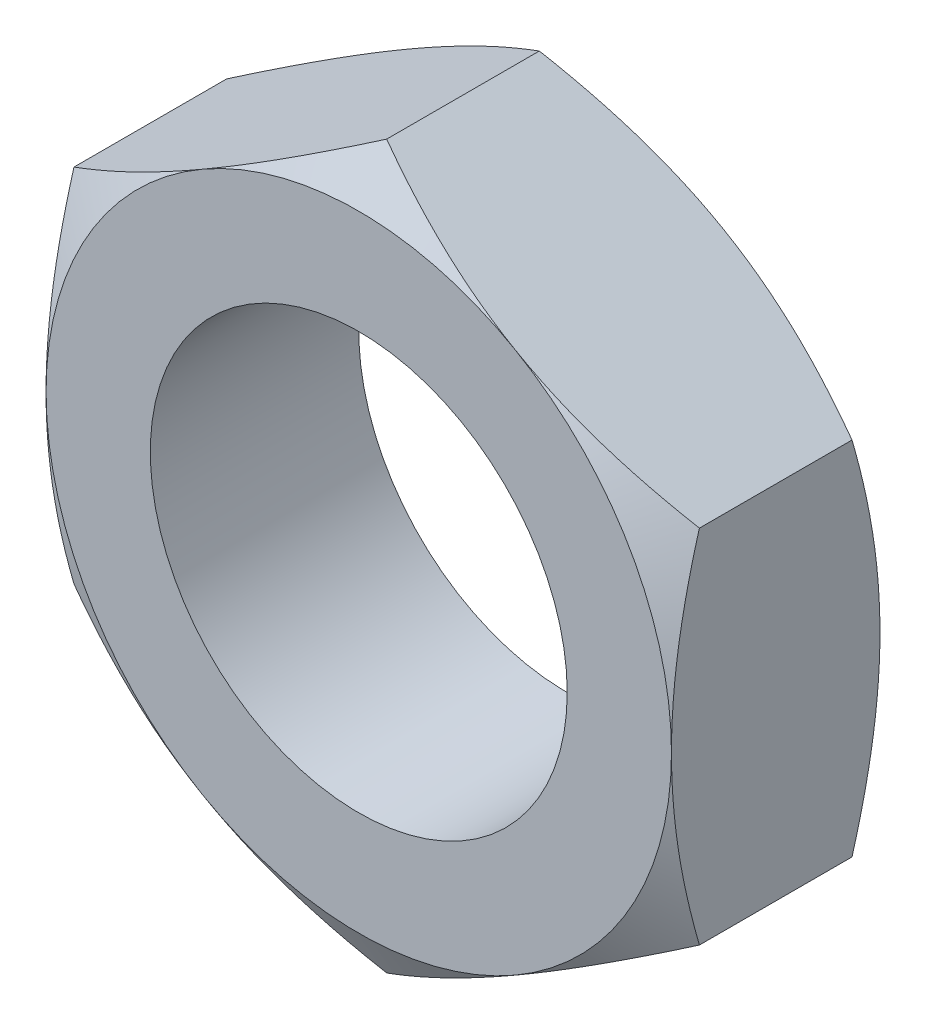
ISO-10303-21;
HEADER;
FILE_DESCRIPTION(('STEP AP214'),'2;1');
FILE_NAME('part.step','',(''),(''),'','','');
FILE_SCHEMA(('AUTOMOTIVE_DESIGN { 1 0 10303 214 1 1 1 1 }'));
ENDSEC;
DATA;
#1=APPLICATION_CONTEXT('core data for automotive mechanical design processes');
#2=APPLICATION_PROTOCOL_DEFINITION('international standard','automotive_design',2000,#1);
#3=PRODUCT_CONTEXT('',#1,'mechanical');
#4=PRODUCT('Part','Part','',(#3));
#5=PRODUCT_RELATED_PRODUCT_CATEGORY('part','',(#4));
#6=PRODUCT_DEFINITION_FORMATION('','',#4);
#7=PRODUCT_DEFINITION_CONTEXT('part definition',#1,'design');
#8=PRODUCT_DEFINITION('design','',#6,#7);
#9=PRODUCT_DEFINITION_SHAPE('','',#8);
#10=(LENGTH_UNIT() NAMED_UNIT(*) SI_UNIT(.MILLI.,.METRE.));
#11=(NAMED_UNIT(*) PLANE_ANGLE_UNIT() SI_UNIT($,.RADIAN.));
#12=(NAMED_UNIT(*) SI_UNIT($,.STERADIAN.) SOLID_ANGLE_UNIT());
#13=UNCERTAINTY_MEASURE_WITH_UNIT(LENGTH_MEASURE(1.E-05),#10,'distance_accuracy_value','');
#14=(GEOMETRIC_REPRESENTATION_CONTEXT(3) GLOBAL_UNCERTAINTY_ASSIGNED_CONTEXT((#13)) GLOBAL_UNIT_ASSIGNED_CONTEXT((#10,
#11,#12)) REPRESENTATION_CONTEXT('',''));
#15=CARTESIAN_POINT('',(0.,0.,0.));
#16=DIRECTION('',(0.,0.,1.));
#17=DIRECTION('',(1.,0.,0.));
#18=AXIS2_PLACEMENT_3D('',#15,#16,#17);
#19=CARTESIAN_POINT('',(0.,17.3205080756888,10.));
#20=DIRECTION('',(0.,0.,1.));
#21=DIRECTION('',(1.,0.,0.));
#22=AXIS2_PLACEMENT_3D('',#19,#20,#21);
#23=PLANE('',#22);
#24=CARTESIAN_POINT('',(0.,0.,10.));
#25=DIRECTION('',(0.,0.,-1.));
#26=DIRECTION('',(-1.,0.,0.));
#27=AXIS2_PLACEMENT_3D('',#24,#25,#26);
#28=CIRCLE('',#27,15.);
#29=CARTESIAN_POINT('',(15.,0.,10.));
#30=VERTEX_POINT('',#29);
#31=CARTESIAN_POINT('',(7.5,-12.9903810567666,10.));
#32=VERTEX_POINT('',#31);
#33=EDGE_CURVE('E121',#30,#32,#28,.T.);
#34=ORIENTED_EDGE('',*,*,#33,.F.);
#35=CARTESIAN_POINT('',(7.5,12.9903810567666,10.));
#36=VERTEX_POINT('',#35);
#37=EDGE_CURVE('E111',#36,#30,#28,.T.);
#38=ORIENTED_EDGE('',*,*,#37,.F.);
#39=CARTESIAN_POINT('',(-7.5,12.9903810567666,10.));
#40=VERTEX_POINT('',#39);
#41=EDGE_CURVE('E120',#40,#36,#28,.T.);
#42=ORIENTED_EDGE('',*,*,#41,.F.);
#43=CARTESIAN_POINT('',(-15.,0.,10.));
#44=VERTEX_POINT('',#43);
#45=EDGE_CURVE('E36',#44,#40,#28,.T.);
#46=ORIENTED_EDGE('',*,*,#45,.F.);
#47=CARTESIAN_POINT('',(-7.5,-12.9903810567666,10.));
#48=VERTEX_POINT('',#47);
#49=EDGE_CURVE('E44',#48,#44,#28,.T.);
#50=ORIENTED_EDGE('',*,*,#49,.F.);
#51=EDGE_CURVE('E138',#32,#48,#28,.T.);
#52=ORIENTED_EDGE('',*,*,#51,.F.);
#53=EDGE_LOOP('',(#34,#38,#42,#46,#50,#52));
#54=FACE_BOUND('',#53,.T.);
#55=CARTESIAN_POINT('',(0.,0.,10.));
#56=DIRECTION('',(0.,0.,1.));
#57=DIRECTION('',(1.,0.,0.));
#58=AXIS2_PLACEMENT_3D('',#55,#56,#57);
#59=CIRCLE('',#58,10.);
#60=CARTESIAN_POINT('',(10.,0.,10.));
#61=VERTEX_POINT('',#60);
#62=EDGE_CURVE('E222',#61,#61,#59,.T.);
#63=ORIENTED_EDGE('',*,*,#62,.F.);
#64=EDGE_LOOP('',(#63));
#65=FACE_BOUND('',#64,.T.);
#66=ADVANCED_FACE('F14',(#54,#65),#23,.T.);
#67=CARTESIAN_POINT('',(0.,17.3205080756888,0.));
#68=DIRECTION('',(0.,0.,1.));
#69=DIRECTION('',(1.,0.,0.));
#70=AXIS2_PLACEMENT_3D('',#67,#68,#69);
#71=PLANE('',#70);
#72=CARTESIAN_POINT('',(0.,0.,0.));
#73=DIRECTION('',(0.,0.,-1.));
#74=DIRECTION('',(-1.,0.,0.));
#75=AXIS2_PLACEMENT_3D('',#72,#73,#74);
#76=CIRCLE('',#75,15.);
#77=CARTESIAN_POINT('',(7.5,12.9903810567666,0.));
#78=VERTEX_POINT('',#77);
#79=CARTESIAN_POINT('',(15.,0.,0.));
#80=VERTEX_POINT('',#79);
#81=EDGE_CURVE('E294',#78,#80,#76,.T.);
#82=ORIENTED_EDGE('',*,*,#81,.T.);
#83=CARTESIAN_POINT('',(7.5,-12.9903810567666,0.));
#84=VERTEX_POINT('',#83);
#85=EDGE_CURVE('E309',#80,#84,#76,.T.);
#86=ORIENTED_EDGE('',*,*,#85,.T.);
#87=CARTESIAN_POINT('',(-7.5,-12.9903810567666,0.));
#88=VERTEX_POINT('',#87);
#89=EDGE_CURVE('E307',#84,#88,#76,.T.);
#90=ORIENTED_EDGE('',*,*,#89,.T.);
#91=CARTESIAN_POINT('',(-15.,0.,0.));
#92=VERTEX_POINT('',#91);
#93=EDGE_CURVE('E302',#88,#92,#76,.T.);
#94=ORIENTED_EDGE('',*,*,#93,.T.);
#95=CARTESIAN_POINT('',(-7.5,12.9903810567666,0.));
#96=VERTEX_POINT('',#95);
#97=EDGE_CURVE('E293',#92,#96,#76,.T.);
#98=ORIENTED_EDGE('',*,*,#97,.T.);
#99=EDGE_CURVE('E287',#96,#78,#76,.T.);
#100=ORIENTED_EDGE('',*,*,#99,.T.);
#101=EDGE_LOOP('',(#82,#86,#90,#94,#98,#100));
#102=FACE_BOUND('',#101,.T.);
#103=CARTESIAN_POINT('',(0.,0.,0.));
#104=DIRECTION('',(0.,0.,1.));
#105=DIRECTION('',(1.,0.,0.));
#106=AXIS2_PLACEMENT_3D('',#103,#104,#105);
#107=CIRCLE('',#106,10.);
#108=CARTESIAN_POINT('',(10.,0.,0.));
#109=VERTEX_POINT('',#108);
#110=EDGE_CURVE('E225',#109,#109,#107,.T.);
#111=ORIENTED_EDGE('',*,*,#110,.T.);
#112=EDGE_LOOP('',(#111));
#113=FACE_BOUND('',#112,.T.);
#114=ADVANCED_FACE('F247',(#102,#113),#71,.F.);
#115=CARTESIAN_POINT('',(15.,8.66025403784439,10.));
#116=DIRECTION('',(-0.5,-0.866025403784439,0.));
#117=DIRECTION('',(0.866025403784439,-0.5,0.));
#118=AXIS2_PLACEMENT_3D('',#115,#116,#117);
#119=PLANE('',#118);
#120=DIRECTION('',(0.,0.,-1.));
#121=VECTOR('',#120,1.);
#122=CARTESIAN_POINT('',(0.,17.3205080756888,10.));
#123=LINE('',#122,#121);
#124=CARTESIAN_POINT('',(0.,17.3205080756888,8.66025403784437));
#125=VERTEX_POINT('',#124);
#126=CARTESIAN_POINT('',(0.,17.3205080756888,1.33974596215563));
#127=VERTEX_POINT('',#126);
#128=EDGE_CURVE('E237',#125,#127,#123,.T.);
#129=ORIENTED_EDGE('',*,*,#128,.F.);
#130=CARTESIAN_POINT('',(-0.000200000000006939,17.3206235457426,8.66018737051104));
#131=CARTESIAN_POINT('',(0.329494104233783,17.130274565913,8.77007821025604));
#132=CARTESIAN_POINT('',(0.660474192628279,16.939183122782,8.87498241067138));
#133=CARTESIAN_POINT('',(1.325088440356,16.5554679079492,9.07343141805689));
#134=CARTESIAN_POINT('',(1.65872343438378,16.3628436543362,9.1669724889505));
#135=CARTESIAN_POINT('',(2.32929228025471,15.9756905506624,9.34143785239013));
#136=CARTESIAN_POINT('',(2.666232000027,15.7811583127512,9.4223322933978));
#137=CARTESIAN_POINT('',(3.34245276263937,15.3907420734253,9.56976735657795));
#138=CARTESIAN_POINT('',(3.6817336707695,15.1948581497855,9.63630879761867));
#139=CARTESIAN_POINT('',(4.35394314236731,14.8067578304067,9.75220762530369));
#140=CARTESIAN_POINT('',(4.68682180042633,14.6145702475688,9.80194861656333));
#141=CARTESIAN_POINT('',(5.35410443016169,14.2293144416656,9.88535325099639));
#142=CARTESIAN_POINT('',(5.68850843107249,14.0362462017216,9.91901658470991));
#143=CARTESIAN_POINT('',(6.35787818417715,13.6497853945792,9.96941592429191));
#144=CARTESIAN_POINT('',(6.69284279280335,13.4563934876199,9.98617204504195));
#145=CARTESIAN_POINT('',(7.36308121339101,13.0694311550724,10.002396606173));
#146=CARTESIAN_POINT('',(7.69835501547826,12.8758607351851,10.0018655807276));
#147=CARTESIAN_POINT('',(8.32514688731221,12.5139822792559,9.98472338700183));
#148=CARTESIAN_POINT('',(8.61670962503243,12.3456484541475,9.97020315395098));
#149=CARTESIAN_POINT('',(9.19916443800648,12.0093680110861,9.92836285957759));
#150=CARTESIAN_POINT('',(9.49005646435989,11.8414214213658,9.90104189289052));
#151=CARTESIAN_POINT('',(10.0710118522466,11.5060066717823,9.83407648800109));
#152=CARTESIAN_POINT('',(10.3610743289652,11.338539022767,9.79442187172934));
#153=CARTESIAN_POINT('',(10.939839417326,11.0043888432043,9.70348489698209));
#154=CARTESIAN_POINT('',(11.2285419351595,10.8377063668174,9.65220174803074));
#155=CARTESIAN_POINT('',(12.1049144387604,10.3317324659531,9.47961313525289));
#156=CARTESIAN_POINT('',(12.6900465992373,9.99390625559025,9.34109882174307));
#157=CARTESIAN_POINT('',(13.8515859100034,9.32329122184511,9.02672803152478));
#158=CARTESIAN_POINT('',(14.4280079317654,8.99049381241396,8.85094538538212));
#159=CARTESIAN_POINT('',(15.0002,8.66013856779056,8.66018737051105));
#160=B_SPLINE_CURVE_WITH_KNOTS('',3,(#130,#131,#132,#133,#134,#135,#136,#137,#138,#139,#140,
#141,#142,#143,#144,#145,#146,#147,#148,#149,#150,#151,#152,#153,#154,#155,#156,#157,#158,#159),
.UNSPECIFIED.,.F.,.F.,(4,2,2,2,2,2,2,2,2,2,2,2,2,2,4),(0.,1.18875411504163,2.37789802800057,
3.56980778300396,4.76164951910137,5.9240737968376,7.08652044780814,8.24758247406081,
9.40860862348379,10.4193068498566,11.4300765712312,12.4416826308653,13.4533574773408,
15.5211962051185,17.5849760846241),.UNSPECIFIED.);
#161=EDGE_CURVE('E321',#125,#36,#160,.T.);
#162=ORIENTED_EDGE('',*,*,#161,.T.);
#163=CARTESIAN_POINT('',(15.,8.66025403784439,8.66025403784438));
#164=VERTEX_POINT('',#163);
#165=EDGE_CURVE('E115',#36,#164,#160,.T.);
#166=ORIENTED_EDGE('',*,*,#165,.T.);
#167=DIRECTION('',(0.,0.,-1.));
#168=VECTOR('',#167,1.);
#169=CARTESIAN_POINT('',(15.,8.66025403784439,10.));
#170=LINE('',#169,#168);
#171=CARTESIAN_POINT('',(15.,8.66025403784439,1.33974596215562));
#172=VERTEX_POINT('',#171);
#173=EDGE_CURVE('E135',#164,#172,#170,.T.);
#174=ORIENTED_EDGE('',*,*,#173,.T.);
#175=CARTESIAN_POINT('',(15.0002,8.66013856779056,1.33981262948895));
#176=CARTESIAN_POINT('',(14.6705058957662,8.85048754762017,1.22992178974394));
#177=CARTESIAN_POINT('',(14.3395258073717,9.04157899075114,1.12501758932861));
#178=CARTESIAN_POINT('',(13.674911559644,9.425294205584,0.926568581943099));
#179=CARTESIAN_POINT('',(13.3412765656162,9.61791845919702,0.833027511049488));
#180=CARTESIAN_POINT('',(12.6707077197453,10.0050715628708,0.658562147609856));
#181=CARTESIAN_POINT('',(12.333767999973,10.199603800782,0.577667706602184));
#182=CARTESIAN_POINT('',(11.6575472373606,10.5900200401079,0.430232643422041));
#183=CARTESIAN_POINT('',(11.3182663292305,10.7859039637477,0.363691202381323));
#184=CARTESIAN_POINT('',(10.6460568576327,11.1740042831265,0.247792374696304));
#185=CARTESIAN_POINT('',(10.3131781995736,11.3661918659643,0.198051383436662));
#186=CARTESIAN_POINT('',(9.64589556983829,11.7514476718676,0.114646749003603));
#187=CARTESIAN_POINT('',(9.31149156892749,11.9445159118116,0.080983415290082));
#188=CARTESIAN_POINT('',(8.64212181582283,12.3309767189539,0.0305840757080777));
#189=CARTESIAN_POINT('',(8.30715720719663,12.5243686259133,0.0138279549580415));
#190=CARTESIAN_POINT('',(7.63691878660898,12.9113309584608,-0.00239660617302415));
#191=CARTESIAN_POINT('',(7.30164498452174,13.1049013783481,-0.00186558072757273));
#192=CARTESIAN_POINT('',(6.67485311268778,13.4667798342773,0.015276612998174));
#193=CARTESIAN_POINT('',(6.38329037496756,13.6351136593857,0.029796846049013));
#194=CARTESIAN_POINT('',(5.8008355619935,13.9713941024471,0.0716371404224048));
#195=CARTESIAN_POINT('',(5.50994353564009,14.1393406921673,0.0989581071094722));
#196=CARTESIAN_POINT('',(4.92898814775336,14.4747554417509,0.165923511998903));
#197=CARTESIAN_POINT('',(4.6389256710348,14.6422230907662,0.205578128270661));
#198=CARTESIAN_POINT('',(4.06016058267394,14.9763732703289,0.296515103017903));
#199=CARTESIAN_POINT('',(3.77145806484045,15.1430557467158,0.347798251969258));
#200=CARTESIAN_POINT('',(2.89508556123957,15.6490296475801,0.520386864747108));
#201=CARTESIAN_POINT('',(2.30995340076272,15.9868558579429,0.658901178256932));
#202=CARTESIAN_POINT('',(1.14841408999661,16.6574708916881,0.973271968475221));
#203=CARTESIAN_POINT('',(0.571992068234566,16.9902683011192,1.14905461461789));
#204=CARTESIAN_POINT('',(-0.000200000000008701,17.3206235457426,1.33981262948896));
#205=B_SPLINE_CURVE_WITH_KNOTS('',3,(#175,#176,#177,#178,#179,#180,#181,#182,#183,#184,#185,
#186,#187,#188,#189,#190,#191,#192,#193,#194,#195,#196,#197,#198,#199,#200,#201,#202,#203,#204),
.UNSPECIFIED.,.F.,.F.,(4,2,2,2,2,2,2,2,2,2,2,2,2,2,4),(0.,1.18875411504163,2.37789802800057,
3.56980778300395,4.76164951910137,5.92407379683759,7.08652044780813,8.2475824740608,
9.40860862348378,10.4193068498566,11.4300765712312,12.4416826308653,13.4533574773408,
15.5211962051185,17.5849760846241),.UNSPECIFIED.);
#206=EDGE_CURVE('E221',#172,#78,#205,.T.);
#207=ORIENTED_EDGE('',*,*,#206,.T.);
#208=EDGE_CURVE('E214',#78,#127,#205,.T.);
#209=ORIENTED_EDGE('',*,*,#208,.T.);
#210=EDGE_LOOP('',(#129,#162,#166,#174,#207,#209));
#211=FACE_BOUND('',#210,.T.);
#212=ADVANCED_FACE('F16',(#211),#119,.F.);
#213=CARTESIAN_POINT('',(0.,17.3205080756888,10.));
#214=DIRECTION('',(0.5,-0.866025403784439,0.));
#215=DIRECTION('',(0.866025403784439,0.5,0.));
#216=AXIS2_PLACEMENT_3D('',#213,#214,#215);
#217=PLANE('',#216);
#218=DIRECTION('',(0.,0.,-1.));
#219=VECTOR('',#218,1.);
#220=CARTESIAN_POINT('',(-15.,8.66025403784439,10.));
#221=LINE('',#220,#219);
#222=CARTESIAN_POINT('',(-15.,8.66025403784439,8.66025403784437));
#223=VERTEX_POINT('',#222);
#224=CARTESIAN_POINT('',(-15.,8.66025403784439,1.33974596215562));
#225=VERTEX_POINT('',#224);
#226=EDGE_CURVE('E235',#223,#225,#221,.T.);
#227=ORIENTED_EDGE('',*,*,#226,.F.);
#228=CARTESIAN_POINT('',(-15.0002,8.66013856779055,8.66018737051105));
#229=CARTESIAN_POINT('',(-14.6705058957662,8.85048754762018,8.77007821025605));
#230=CARTESIAN_POINT('',(-14.3395258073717,9.04157899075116,8.87498241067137));
#231=CARTESIAN_POINT('',(-13.674911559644,9.42529420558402,9.07343141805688));
#232=CARTESIAN_POINT('',(-13.3412765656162,9.61791845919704,9.16697248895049));
#233=CARTESIAN_POINT('',(-12.6707077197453,10.0050715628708,9.34143785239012));
#234=CARTESIAN_POINT('',(-12.333767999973,10.199603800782,9.42233229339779));
#235=CARTESIAN_POINT('',(-11.6575472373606,10.5900200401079,9.56976735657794));
#236=CARTESIAN_POINT('',(-11.3182663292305,10.7859039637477,9.63630879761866));
#237=CARTESIAN_POINT('',(-10.6460568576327,11.1740042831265,9.75220762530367));
#238=CARTESIAN_POINT('',(-10.3131781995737,11.3661918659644,9.80194861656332));
#239=CARTESIAN_POINT('',(-9.64589556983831,11.7514476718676,9.88535325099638));
#240=CARTESIAN_POINT('',(-9.31149156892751,11.9445159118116,9.9190165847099));
#241=CARTESIAN_POINT('',(-8.64212181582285,12.3309767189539,9.9694159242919));
#242=CARTESIAN_POINT('',(-8.30715720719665,12.5243686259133,9.98617204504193));
#243=CARTESIAN_POINT('',(-7.636918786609,12.9113309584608,10.002396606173));
#244=CARTESIAN_POINT('',(-7.30164498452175,13.1049013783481,10.0018655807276));
#245=CARTESIAN_POINT('',(-6.6748531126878,13.4667798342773,9.98472338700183));
#246=CARTESIAN_POINT('',(-6.38329037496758,13.6351136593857,9.97020315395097));
#247=CARTESIAN_POINT('',(-5.80083556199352,13.9713941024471,9.92836285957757));
#248=CARTESIAN_POINT('',(-5.50994353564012,14.1393406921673,9.90104189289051));
#249=CARTESIAN_POINT('',(-4.92898814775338,14.4747554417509,9.83407648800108));
#250=CARTESIAN_POINT('',(-4.63892567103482,14.6422230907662,9.79442187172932));
#251=CARTESIAN_POINT('',(-4.06016058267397,14.9763732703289,9.70348489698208));
#252=CARTESIAN_POINT('',(-3.77145806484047,15.1430557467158,9.65220174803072));
#253=CARTESIAN_POINT('',(-2.8950855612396,15.6490296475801,9.47961313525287));
#254=CARTESIAN_POINT('',(-2.30995340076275,15.9868558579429,9.34109882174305));
#255=CARTESIAN_POINT('',(-1.14841408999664,16.6574708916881,9.02672803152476));
#256=CARTESIAN_POINT('',(-0.571992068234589,16.9902683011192,8.8509453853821));
#257=CARTESIAN_POINT('',(0.000199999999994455,17.3206235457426,8.66018737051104));
#258=B_SPLINE_CURVE_WITH_KNOTS('',3,(#228,#229,#230,#231,#232,#233,#234,#235,#236,#237,#238,
#239,#240,#241,#242,#243,#244,#245,#246,#247,#248,#249,#250,#251,#252,#253,#254,#255,#256,#257),
.UNSPECIFIED.,.F.,.F.,(4,2,2,2,2,2,2,2,2,2,2,2,2,2,4),(0.,1.18875411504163,2.37789802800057,
3.56980778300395,4.76164951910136,5.92407379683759,7.08652044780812,8.24758247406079,
9.40860862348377,10.4193068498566,11.4300765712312,12.4416826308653,13.4533574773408,
15.5211962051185,17.5849760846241),.UNSPECIFIED.);
#259=EDGE_CURVE('E182',#223,#40,#258,.T.);
#260=ORIENTED_EDGE('',*,*,#259,.T.);
#261=EDGE_CURVE('E176',#40,#125,#258,.T.);
#262=ORIENTED_EDGE('',*,*,#261,.T.);
#263=ORIENTED_EDGE('',*,*,#128,.T.);
#264=CARTESIAN_POINT('',(0.000199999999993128,17.3206235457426,1.33981262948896));
#265=CARTESIAN_POINT('',(-0.329494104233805,17.130274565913,1.22992178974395));
#266=CARTESIAN_POINT('',(-0.660474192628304,16.9391831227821,1.12501758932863));
#267=CARTESIAN_POINT('',(-1.32508844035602,16.5554679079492,0.926568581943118));
#268=CARTESIAN_POINT('',(-1.65872343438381,16.3628436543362,0.833027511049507));
#269=CARTESIAN_POINT('',(-2.32929228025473,15.9756905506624,0.658562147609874));
#270=CARTESIAN_POINT('',(-2.66623200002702,15.7811583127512,0.577667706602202));
#271=CARTESIAN_POINT('',(-3.34245276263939,15.3907420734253,0.430232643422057));
#272=CARTESIAN_POINT('',(-3.68173367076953,15.1948581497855,0.363691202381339));
#273=CARTESIAN_POINT('',(-4.35394314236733,14.8067578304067,0.24779237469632));
#274=CARTESIAN_POINT('',(-4.68682180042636,14.6145702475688,0.198051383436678));
#275=CARTESIAN_POINT('',(-5.35410443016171,14.2293144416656,0.114646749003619));
#276=CARTESIAN_POINT('',(-5.68850843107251,14.0362462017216,0.0809834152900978));
#277=CARTESIAN_POINT('',(-6.35787818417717,13.6497853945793,0.0305840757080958));
#278=CARTESIAN_POINT('',(-6.69284279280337,13.4563934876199,0.0138279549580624));
#279=CARTESIAN_POINT('',(-7.36308121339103,13.0694311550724,-0.00239660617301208));
#280=CARTESIAN_POINT('',(-7.69835501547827,12.8758607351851,-0.00186558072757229));
#281=CARTESIAN_POINT('',(-8.32514688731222,12.5139822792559,0.0152766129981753));
#282=CARTESIAN_POINT('',(-8.61670962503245,12.3456484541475,0.029796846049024));
#283=CARTESIAN_POINT('',(-9.1991644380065,12.0093680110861,0.0716371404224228));
#284=CARTESIAN_POINT('',(-9.49005646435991,11.8414214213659,0.0989581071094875));
#285=CARTESIAN_POINT('',(-10.0710118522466,11.5060066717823,0.165923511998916));
#286=CARTESIAN_POINT('',(-10.3610743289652,11.338539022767,0.205578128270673));
#287=CARTESIAN_POINT('',(-10.9398394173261,11.0043888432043,0.296515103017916));
#288=CARTESIAN_POINT('',(-11.2285419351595,10.8377063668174,0.347798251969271));
#289=CARTESIAN_POINT('',(-12.1049144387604,10.3317324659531,0.520386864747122));
#290=CARTESIAN_POINT('',(-12.6900465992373,9.99390625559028,0.658901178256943));
#291=CARTESIAN_POINT('',(-13.8515859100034,9.32329122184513,0.973271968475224));
#292=CARTESIAN_POINT('',(-14.4280079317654,8.99049381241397,1.14905461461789));
#293=CARTESIAN_POINT('',(-15.0002,8.66013856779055,1.33981262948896));
#294=B_SPLINE_CURVE_WITH_KNOTS('',3,(#264,#265,#266,#267,#268,#269,#270,#271,#272,#273,#274,
#275,#276,#277,#278,#279,#280,#281,#282,#283,#284,#285,#286,#287,#288,#289,#290,#291,#292,#293),
.UNSPECIFIED.,.F.,.F.,(4,2,2,2,2,2,2,2,2,2,2,2,2,2,4),(0.,1.18875411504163,2.37789802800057,
3.56980778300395,4.76164951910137,5.9240737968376,7.08652044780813,8.2475824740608,
9.40860862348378,10.4193068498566,11.4300765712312,12.4416826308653,13.4533574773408,
15.5211962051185,17.5849760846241),.UNSPECIFIED.);
#295=EDGE_CURVE('E206',#127,#96,#294,.T.);
#296=ORIENTED_EDGE('',*,*,#295,.T.);
#297=EDGE_CURVE('E198',#96,#225,#294,.T.);
#298=ORIENTED_EDGE('',*,*,#297,.T.);
#299=EDGE_LOOP('',(#227,#260,#262,#263,#296,#298));
#300=FACE_BOUND('',#299,.T.);
#301=ADVANCED_FACE('F190',(#300),#217,.F.);
#302=CARTESIAN_POINT('',(-15.,8.66025403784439,10.));
#303=DIRECTION('',(1.,0.,0.));
#304=DIRECTION('',(0.,1.,0.));
#305=AXIS2_PLACEMENT_3D('',#302,#303,#304);
#306=PLANE('',#305);
#307=DIRECTION('',(0.,0.,-1.));
#308=VECTOR('',#307,1.);
#309=CARTESIAN_POINT('',(-15.,-8.66025403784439,10.));
#310=LINE('',#309,#308);
#311=CARTESIAN_POINT('',(-15.,-8.66025403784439,8.66025403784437));
#312=VERTEX_POINT('',#311);
#313=CARTESIAN_POINT('',(-15.,-8.66025403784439,1.33974596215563));
#314=VERTEX_POINT('',#313);
#315=EDGE_CURVE('E233',#312,#314,#310,.T.);
#316=ORIENTED_EDGE('',*,*,#315,.F.);
#317=CARTESIAN_POINT('',(-15.,-23.1722632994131,2.72335987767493));
#318=CARTESIAN_POINT('',(-15.,-22.8450815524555,2.88193091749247));
#319=CARTESIAN_POINT('',(-15.,-22.5175134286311,3.03970435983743));
#320=CARTESIAN_POINT('',(-15.,-21.8615237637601,3.35347522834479));
#321=CARTESIAN_POINT('',(-15.,-21.5331022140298,3.50947263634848));
#322=CARTESIAN_POINT('',(-15.,-20.54634772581,3.97457127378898));
#323=CARTESIAN_POINT('',(-15.,-19.8866231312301,4.28073119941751));
#324=CARTESIAN_POINT('',(-15.,-18.5590950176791,4.88500677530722));
#325=CARTESIAN_POINT('',(-15.,-17.8912670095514,5.18306875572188));
#326=CARTESIAN_POINT('',(-15.,-16.5502684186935,5.76687895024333));
#327=CARTESIAN_POINT('',(-15.,-15.8770980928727,6.05262775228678));
#328=CARTESIAN_POINT('',(-15.,-14.5029452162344,6.61734419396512));
#329=CARTESIAN_POINT('',(-15.,-13.8017561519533,6.89581195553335));
#330=CARTESIAN_POINT('',(-15.,-12.3911362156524,7.43145355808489));
#331=CARTESIAN_POINT('',(-15.,-11.6817044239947,7.6886249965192));
#332=CARTESIAN_POINT('',(-15.,-10.2548511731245,8.17485260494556));
#333=CARTESIAN_POINT('',(-15.,-9.53744954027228,8.40396648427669));
#334=CARTESIAN_POINT('',(-15.,-8.09228773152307,8.82667983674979));
#335=CARTESIAN_POINT('',(-15.,-7.36453092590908,9.02029059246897));
#336=CARTESIAN_POINT('',(-15.,-6.26702285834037,9.27649993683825));
#337=CARTESIAN_POINT('',(-15.,-5.90120035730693,9.35603341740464));
#338=CARTESIAN_POINT('',(-15.,-5.16707281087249,9.50274242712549));
#339=CARTESIAN_POINT('',(-15.,-4.79876781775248,9.56991821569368));
#340=CARTESIAN_POINT('',(-15.,-4.05993442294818,9.69072085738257));
#341=CARTESIAN_POINT('',(-15.,-3.6894060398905,9.74434782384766));
#342=CARTESIAN_POINT('',(-15.,-2.94652897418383,9.83697919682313));
#343=CARTESIAN_POINT('',(-15.,-2.57418036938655,9.87598422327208));
#344=CARTESIAN_POINT('',(-15.,-1.83300193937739,9.9381132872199));
#345=CARTESIAN_POINT('',(-15.,-1.46418888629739,9.9614361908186));
#346=CARTESIAN_POINT('',(-15.,-0.725908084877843,9.99247055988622));
#347=CARTESIAN_POINT('',(-15.,-0.356440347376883,10.0001822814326));
#348=CARTESIAN_POINT('',(-15.,0.382491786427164,9.99981118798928));
#349=CARTESIAN_POINT('',(-15.,0.751956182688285,9.99172826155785));
#350=CARTESIAN_POINT('',(-15.,1.49021750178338,9.95996347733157));
#351=CARTESIAN_POINT('',(-15.,1.85901439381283,9.93628091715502));
#352=CARTESIAN_POINT('',(-15.,2.74811883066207,9.86088082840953));
#353=CARTESIAN_POINT('',(-15.,3.26779671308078,9.80160802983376));
#354=CARTESIAN_POINT('',(-15.,4.30323876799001,9.65533770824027));
#355=CARTESIAN_POINT('',(-15.,4.81900238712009,9.56833633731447));
#356=CARTESIAN_POINT('',(-15.,5.84614440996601,9.36970404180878));
#357=CARTESIAN_POINT('',(-15.,6.35751900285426,9.25805359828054));
#358=CARTESIAN_POINT('',(-15.,7.37511063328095,9.01352522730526));
#359=CARTESIAN_POINT('',(-15.,7.88132775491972,8.88064764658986));
#360=CARTESIAN_POINT('',(-15.,8.89964347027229,8.59377852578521));
#361=CARTESIAN_POINT('',(-15.,9.41162930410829,8.43938947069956));
#362=CARTESIAN_POINT('',(-15.,10.4305565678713,8.11486119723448));
#363=CARTESIAN_POINT('',(-15.,10.9374979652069,7.94472187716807));
#364=CARTESIAN_POINT('',(-15.,11.9465900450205,7.59137675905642));
#365=CARTESIAN_POINT('',(-15.,12.4487423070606,7.40817545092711));
#366=CARTESIAN_POINT('',(-15.,13.4488998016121,7.03084180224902));
#367=CARTESIAN_POINT('',(-15.,13.9469050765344,6.83670957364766));
#368=CARTESIAN_POINT('',(-15.,15.0962017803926,6.37647495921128));
#369=CARTESIAN_POINT('',(-15.,15.7461528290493,6.10703097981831));
#370=CARTESIAN_POINT('',(-15.,17.0407284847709,5.55560250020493));
#371=CARTESIAN_POINT('',(-15.,17.6853527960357,5.27361730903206));
#372=CARTESIAN_POINT('',(-15.,18.9702320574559,4.69954536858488));
#373=CARTESIAN_POINT('',(-15.,19.6104861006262,4.40745659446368));
#374=CARTESIAN_POINT('',(-15.,20.8872017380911,3.81515510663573));
#375=CARTESIAN_POINT('',(-15.,21.5236634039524,3.51494254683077));
#376=CARTESIAN_POINT('',(-15.,22.7940491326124,2.90756319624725));
#377=CARTESIAN_POINT('',(-15.,23.4279699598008,2.60038964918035));
#378=CARTESIAN_POINT('',(-15.,24.6931173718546,1.98054478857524));
#379=CARTESIAN_POINT('',(-15.,25.3243439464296,1.66787345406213));
#380=CARTESIAN_POINT('',(-15.,26.5844326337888,1.03798894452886));
#381=CARTESIAN_POINT('',(-15.,27.2132950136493,0.72077630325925));
#382=CARTESIAN_POINT('',(-15.,28.4690627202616,0.082498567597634));
#383=CARTESIAN_POINT('',(-15.,29.0959680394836,-0.238566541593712));
#384=CARTESIAN_POINT('',(-15.,30.8733695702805,-1.15468108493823));
#385=CARTESIAN_POINT('',(-15.,32.0218708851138,-1.75360098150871));
#386=CARTESIAN_POINT('',(-15.,34.3145660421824,-2.95969822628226));
#387=CARTESIAN_POINT('',(-15.,35.4587597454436,-3.56687583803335));
#388=CARTESIAN_POINT('',(-15.,37.7410795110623,-4.78615498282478));
#389=CARTESIAN_POINT('',(-15.,38.8792135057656,-5.39824167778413));
#390=CARTESIAN_POINT('',(-15.,40.5843689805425,-6.3200809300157));
#391=CARTESIAN_POINT('',(-15.,41.1523988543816,-6.62797103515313));
#392=CARTESIAN_POINT('',(-15.,42.2878522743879,-7.2448652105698));
#393=CARTESIAN_POINT('',(-15.,42.8552758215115,-7.55386927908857));
#394=CARTESIAN_POINT('',(-15.,43.4224300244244,-7.86336706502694));
#395=B_SPLINE_CURVE_WITH_KNOTS('',3,(#317,#318,#319,#320,#321,#322,#323,#324,#325,#326,#327,
#328,#329,#330,#331,#332,#333,#334,#335,#336,#337,#338,#339,#340,#341,#342,#343,#344,#345,#346,
#347,#348,#349,#350,#351,#352,#353,#354,#355,#356,#357,#358,#359,#360,#361,#362,#363,#364,#365,
#366,#367,#368,#369,#370,#371,#372,#373,#374,#375,#376,#377,#378,#379,#380,#381,#382,#383,#384,
#385,#386,#387,#388,#389,#390,#391,#392,#393,#394),.UNSPECIFIED.,.F.,.F.,(4,2,2,2,2,2,2,2,2,2,2,
2,2,2,2,2,2,2,2,2,2,2,2,2,2,2,2,2,2,2,2,2,2,2,2,2,2,2,4),(0.,1.09074729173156,2.1815057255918,
4.36335006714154,6.55722608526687,8.75099723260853,11.014114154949,13.2774860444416,
15.5361214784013,17.7940378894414,18.9169680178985,20.03987457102,21.1627717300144,
22.2856212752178,23.3939489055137,24.5022583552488,25.6105756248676,26.7189428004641,
28.2872145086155,29.8557039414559,31.4254399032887,32.9951502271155,34.5991191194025,
36.2030983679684,37.8065288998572,39.4099430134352,41.5205319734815,43.6312373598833,
45.7423682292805,47.8534591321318,49.9666951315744,52.0799391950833,54.1929368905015,
56.3059427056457,60.1917437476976,64.0776690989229,67.9545056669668,69.8928257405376,
71.8311427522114),.UNSPECIFIED.);
#396=EDGE_CURVE('E308',#312,#44,#395,.T.);
#397=ORIENTED_EDGE('',*,*,#396,.T.);
#398=EDGE_CURVE('E183',#44,#223,#395,.T.);
#399=ORIENTED_EDGE('',*,*,#398,.T.);
#400=ORIENTED_EDGE('',*,*,#226,.T.);
#401=CARTESIAN_POINT('',(-15.,-23.1722632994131,7.27664012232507));
#402=CARTESIAN_POINT('',(-15.,-22.8450815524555,7.11806908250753));
#403=CARTESIAN_POINT('',(-15.,-22.5175134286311,6.96029564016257));
#404=CARTESIAN_POINT('',(-15.,-21.8615237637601,6.64652477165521));
#405=CARTESIAN_POINT('',(-15.,-21.5331022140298,6.49052736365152));
#406=CARTESIAN_POINT('',(-15.,-20.54634772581,6.02542872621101));
#407=CARTESIAN_POINT('',(-15.,-19.8866231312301,5.71926880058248));
#408=CARTESIAN_POINT('',(-15.,-18.5590950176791,5.11499322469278));
#409=CARTESIAN_POINT('',(-15.,-17.8912670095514,4.81693124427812));
#410=CARTESIAN_POINT('',(-15.,-16.5502684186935,4.23312104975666));
#411=CARTESIAN_POINT('',(-15.,-15.8770980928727,3.94737224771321));
#412=CARTESIAN_POINT('',(-15.,-14.5029452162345,3.38265580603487));
#413=CARTESIAN_POINT('',(-15.,-13.8017561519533,3.10418804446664));
#414=CARTESIAN_POINT('',(-15.,-12.3911362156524,2.5685464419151));
#415=CARTESIAN_POINT('',(-15.,-11.6817044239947,2.31137500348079));
#416=CARTESIAN_POINT('',(-15.,-10.2548511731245,1.82514739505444));
#417=CARTESIAN_POINT('',(-15.,-9.53744954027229,1.59603351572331));
#418=CARTESIAN_POINT('',(-15.,-8.09228773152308,1.1733201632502));
#419=CARTESIAN_POINT('',(-15.,-7.36453092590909,0.979709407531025));
#420=CARTESIAN_POINT('',(-15.,-6.26702285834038,0.723500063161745));
#421=CARTESIAN_POINT('',(-15.,-5.90120035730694,0.643966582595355));
#422=CARTESIAN_POINT('',(-15.,-5.1670728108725,0.497257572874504));
#423=CARTESIAN_POINT('',(-15.,-4.79876781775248,0.430081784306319));
#424=CARTESIAN_POINT('',(-15.,-4.05993442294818,0.309279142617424));
#425=CARTESIAN_POINT('',(-15.,-3.6894060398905,0.255652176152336));
#426=CARTESIAN_POINT('',(-15.,-2.94652897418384,0.163020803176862));
#427=CARTESIAN_POINT('',(-15.,-2.57418036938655,0.124015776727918));
#428=CARTESIAN_POINT('',(-15.,-1.83300193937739,0.0618867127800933));
#429=CARTESIAN_POINT('',(-15.,-1.4641888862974,0.0385638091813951));
#430=CARTESIAN_POINT('',(-15.,-0.725908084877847,0.00752944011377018));
#431=CARTESIAN_POINT('',(-15.,-0.356440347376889,-0.000182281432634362));
#432=CARTESIAN_POINT('',(-15.,0.382491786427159,0.000188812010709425));
#433=CARTESIAN_POINT('',(-15.,0.751956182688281,0.00827173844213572));
#434=CARTESIAN_POINT('',(-15.,1.49021750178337,0.040036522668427));
#435=CARTESIAN_POINT('',(-15.,1.85901439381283,0.0637190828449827));
#436=CARTESIAN_POINT('',(-15.,2.74811883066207,0.139119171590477));
#437=CARTESIAN_POINT('',(-15.,3.26779671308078,0.198391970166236));
#438=CARTESIAN_POINT('',(-15.,4.30323876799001,0.344662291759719));
#439=CARTESIAN_POINT('',(-15.,4.81900238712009,0.431663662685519));
#440=CARTESIAN_POINT('',(-15.,5.84614440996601,0.630295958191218));
#441=CARTESIAN_POINT('',(-15.,6.35751900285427,0.741946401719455));
#442=CARTESIAN_POINT('',(-15.,7.37511063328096,0.986474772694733));
#443=CARTESIAN_POINT('',(-15.,7.88132775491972,1.11935235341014));
#444=CARTESIAN_POINT('',(-15.,8.8996434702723,1.40622147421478));
#445=CARTESIAN_POINT('',(-15.,9.41162930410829,1.56061052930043));
#446=CARTESIAN_POINT('',(-15.,10.4305565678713,1.88513880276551));
#447=CARTESIAN_POINT('',(-15.,10.9374979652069,2.05527812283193));
#448=CARTESIAN_POINT('',(-15.,11.9465900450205,2.40862324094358));
#449=CARTESIAN_POINT('',(-15.,12.4487423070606,2.59182454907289));
#450=CARTESIAN_POINT('',(-15.,13.4488998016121,2.96915819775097));
#451=CARTESIAN_POINT('',(-15.,13.9469050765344,3.16329042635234));
#452=CARTESIAN_POINT('',(-15.,15.0962017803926,3.62352504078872));
#453=CARTESIAN_POINT('',(-15.,15.7461528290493,3.89296902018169));
#454=CARTESIAN_POINT('',(-15.,17.0407284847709,4.44439749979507));
#455=CARTESIAN_POINT('',(-15.,17.6853527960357,4.72638269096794));
#456=CARTESIAN_POINT('',(-15.,18.9702320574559,5.30045463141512));
#457=CARTESIAN_POINT('',(-15.,19.6104861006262,5.59254340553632));
#458=CARTESIAN_POINT('',(-15.,20.8872017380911,6.18484489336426));
#459=CARTESIAN_POINT('',(-15.,21.5236634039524,6.48505745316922));
#460=CARTESIAN_POINT('',(-15.,22.7940491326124,7.09243680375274));
#461=CARTESIAN_POINT('',(-15.,23.4279699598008,7.39961035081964));
#462=CARTESIAN_POINT('',(-15.,24.6931173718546,8.01945521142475));
#463=CARTESIAN_POINT('',(-15.,25.3243439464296,8.33212654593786));
#464=CARTESIAN_POINT('',(-15.,26.5844326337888,8.96201105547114));
#465=CARTESIAN_POINT('',(-15.,27.2132950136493,9.27922369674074));
#466=CARTESIAN_POINT('',(-15.,28.4690627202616,9.91750143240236));
#467=CARTESIAN_POINT('',(-15.,29.0959680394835,10.2385665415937));
#468=CARTESIAN_POINT('',(-15.,30.8733695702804,11.1546810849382));
#469=CARTESIAN_POINT('',(-15.,32.0218708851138,11.7536009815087));
#470=CARTESIAN_POINT('',(-15.,34.3145660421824,12.9596982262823));
#471=CARTESIAN_POINT('',(-15.,35.4587597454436,13.5668758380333));
#472=CARTESIAN_POINT('',(-15.,37.7410795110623,14.7861549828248));
#473=CARTESIAN_POINT('',(-15.,38.8792135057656,15.3982416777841));
#474=CARTESIAN_POINT('',(-15.,40.5843689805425,16.3200809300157));
#475=CARTESIAN_POINT('',(-15.,41.1523988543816,16.6279710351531));
#476=CARTESIAN_POINT('',(-15.,42.2878522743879,17.2448652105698));
#477=CARTESIAN_POINT('',(-15.,42.8552758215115,17.5538692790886));
#478=CARTESIAN_POINT('',(-15.,43.4224300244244,17.8633670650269));
#479=B_SPLINE_CURVE_WITH_KNOTS('',3,(#401,#402,#403,#404,#405,#406,#407,#408,#409,#410,#411,
#412,#413,#414,#415,#416,#417,#418,#419,#420,#421,#422,#423,#424,#425,#426,#427,#428,#429,#430,
#431,#432,#433,#434,#435,#436,#437,#438,#439,#440,#441,#442,#443,#444,#445,#446,#447,#448,#449,
#450,#451,#452,#453,#454,#455,#456,#457,#458,#459,#460,#461,#462,#463,#464,#465,#466,#467,#468,
#469,#470,#471,#472,#473,#474,#475,#476,#477,#478),.UNSPECIFIED.,.F.,.F.,(4,2,2,2,2,2,2,2,2,2,2,
2,2,2,2,2,2,2,2,2,2,2,2,2,2,2,2,2,2,2,2,2,2,2,2,2,2,2,4),(0.,1.09074729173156,2.1815057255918,
4.36335006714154,6.55722608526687,8.75099723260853,11.014114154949,13.2774860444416,
15.5361214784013,17.7940378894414,18.9169680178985,20.03987457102,21.1627717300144,
22.2856212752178,23.3939489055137,24.5022583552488,25.6105756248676,26.7189428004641,
28.2872145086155,29.8557039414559,31.4254399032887,32.9951502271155,34.5991191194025,
36.2030983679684,37.8065288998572,39.4099430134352,41.5205319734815,43.6312373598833,
45.7423682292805,47.8534591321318,49.9666951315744,52.0799391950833,54.1929368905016,
56.3059427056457,60.1917437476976,64.0776690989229,67.9545056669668,69.8928257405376,
71.8311427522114),.UNSPECIFIED.);
#480=EDGE_CURVE('E207',#225,#92,#479,.F.);
#481=ORIENTED_EDGE('',*,*,#480,.T.);
#482=EDGE_CURVE('E208',#92,#314,#479,.F.);
#483=ORIENTED_EDGE('',*,*,#482,.T.);
#484=EDGE_LOOP('',(#316,#397,#399,#400,#481,#483));
#485=FACE_BOUND('',#484,.T.);
#486=ADVANCED_FACE('F193',(#485),#306,.F.);
#487=CARTESIAN_POINT('',(-15.,-8.66025403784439,10.));
#488=DIRECTION('',(0.5,0.866025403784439,0.));
#489=DIRECTION('',(-0.866025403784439,0.5,0.));
#490=AXIS2_PLACEMENT_3D('',#487,#488,#489);
#491=PLANE('',#490);
#492=DIRECTION('',(0.,0.,-1.));
#493=VECTOR('',#492,1.);
#494=CARTESIAN_POINT('',(0.,-17.3205080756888,10.));
#495=LINE('',#494,#493);
#496=CARTESIAN_POINT('',(0.,-17.3205080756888,8.66025403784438));
#497=VERTEX_POINT('',#496);
#498=CARTESIAN_POINT('',(0.,-17.3205080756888,1.33974596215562));
#499=VERTEX_POINT('',#498);
#500=EDGE_CURVE('E231',#497,#499,#495,.T.);
#501=ORIENTED_EDGE('',*,*,#500,.F.);
#502=CARTESIAN_POINT('',(0.000199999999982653,-17.3206235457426,8.66018737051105));
#503=CARTESIAN_POINT('',(-0.329494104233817,-17.130274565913,8.77007821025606));
#504=CARTESIAN_POINT('',(-0.660474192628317,-16.939183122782,8.87498241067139));
#505=CARTESIAN_POINT('',(-1.32508844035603,-16.5554679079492,9.0734314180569));
#506=CARTESIAN_POINT('',(-1.65872343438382,-16.3628436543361,9.16697248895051));
#507=CARTESIAN_POINT('',(-2.32929228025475,-15.9756905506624,9.34143785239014));
#508=CARTESIAN_POINT('',(-2.66623200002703,-15.7811583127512,9.42233229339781));
#509=CARTESIAN_POINT('',(-3.3424527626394,-15.3907420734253,9.56976735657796));
#510=CARTESIAN_POINT('',(-3.68173367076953,-15.1948581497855,9.63630879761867));
#511=CARTESIAN_POINT('',(-4.35394314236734,-14.8067578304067,9.75220762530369));
#512=CARTESIAN_POINT('',(-4.68682180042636,-14.6145702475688,9.80194861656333));
#513=CARTESIAN_POINT('',(-5.35410443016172,-14.2293144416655,9.88535325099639));
#514=CARTESIAN_POINT('',(-5.68850843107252,-14.0362462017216,9.91901658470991));
#515=CARTESIAN_POINT('',(-6.35787818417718,-13.6497853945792,9.96941592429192));
#516=CARTESIAN_POINT('',(-6.69284279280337,-13.4563934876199,9.98617204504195));
#517=CARTESIAN_POINT('',(-7.36308121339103,-13.0694311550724,10.002396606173));
#518=CARTESIAN_POINT('',(-7.69835501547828,-12.8758607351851,10.0018655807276));
#519=CARTESIAN_POINT('',(-8.32514688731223,-12.5139822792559,9.98472338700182));
#520=CARTESIAN_POINT('',(-8.61670962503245,-12.3456484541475,9.97020315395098));
#521=CARTESIAN_POINT('',(-9.1991644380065,-12.0093680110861,9.92836285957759));
#522=CARTESIAN_POINT('',(-9.49005646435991,-11.8414214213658,9.90104189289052));
#523=CARTESIAN_POINT('',(-10.0710118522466,-11.5060066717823,9.83407648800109));
#524=CARTESIAN_POINT('',(-10.3610743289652,-11.338539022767,9.79442187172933));
#525=CARTESIAN_POINT('',(-10.9398394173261,-11.0043888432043,9.70348489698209));
#526=CARTESIAN_POINT('',(-11.2285419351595,-10.8377063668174,9.65220174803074));
#527=CARTESIAN_POINT('',(-12.1049144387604,-10.3317324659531,9.47961313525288));
#528=CARTESIAN_POINT('',(-12.6900465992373,-9.99390625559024,9.34109882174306));
#529=CARTESIAN_POINT('',(-13.8515859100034,-9.3232912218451,9.02672803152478));
#530=CARTESIAN_POINT('',(-14.4280079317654,-8.99049381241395,8.85094538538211));
#531=CARTESIAN_POINT('',(-15.0002,-8.66013856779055,8.66018737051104));
#532=B_SPLINE_CURVE_WITH_KNOTS('',3,(#502,#503,#504,#505,#506,#507,#508,#509,#510,#511,#512,
#513,#514,#515,#516,#517,#518,#519,#520,#521,#522,#523,#524,#525,#526,#527,#528,#529,#530,#531),
.UNSPECIFIED.,.F.,.F.,(4,2,2,2,2,2,2,2,2,2,2,2,2,2,4),(0.,1.18875411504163,2.37789802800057,
3.56980778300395,4.76164951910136,5.92407379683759,7.08652044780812,8.24758247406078,
9.40860862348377,10.4193068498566,11.4300765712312,12.4416826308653,13.4533574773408,
15.5211962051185,17.584976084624),.UNSPECIFIED.);
#533=EDGE_CURVE('E170',#497,#48,#532,.T.);
#534=ORIENTED_EDGE('',*,*,#533,.T.);
#535=EDGE_CURVE('E314',#48,#312,#532,.T.);
#536=ORIENTED_EDGE('',*,*,#535,.T.);
#537=ORIENTED_EDGE('',*,*,#315,.T.);
#538=CARTESIAN_POINT('',(-15.0002,-8.66013856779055,1.33981262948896));
#539=CARTESIAN_POINT('',(-14.6705058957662,-8.85048754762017,1.22992178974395));
#540=CARTESIAN_POINT('',(-14.3395258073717,-9.04157899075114,1.12501758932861));
#541=CARTESIAN_POINT('',(-13.674911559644,-9.425294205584,0.9265685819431));
#542=CARTESIAN_POINT('',(-13.3412765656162,-9.61791845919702,0.83302751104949));
#543=CARTESIAN_POINT('',(-12.6707077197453,-10.0050715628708,0.658562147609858));
#544=CARTESIAN_POINT('',(-12.333767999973,-10.199603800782,0.577667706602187));
#545=CARTESIAN_POINT('',(-11.6575472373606,-10.5900200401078,0.430232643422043));
#546=CARTESIAN_POINT('',(-11.3182663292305,-10.7859039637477,0.363691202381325));
#547=CARTESIAN_POINT('',(-10.6460568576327,-11.1740042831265,0.247792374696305));
#548=CARTESIAN_POINT('',(-10.3131781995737,-11.3661918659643,0.198051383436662));
#549=CARTESIAN_POINT('',(-9.6458955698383,-11.7514476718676,0.114646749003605));
#550=CARTESIAN_POINT('',(-9.31149156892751,-11.9445159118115,0.0809834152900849));
#551=CARTESIAN_POINT('',(-8.64212181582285,-12.3309767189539,0.0305840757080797));
#552=CARTESIAN_POINT('',(-8.30715720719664,-12.5243686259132,0.0138279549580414));
#553=CARTESIAN_POINT('',(-7.636918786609,-12.9113309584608,-0.00239660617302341));
#554=CARTESIAN_POINT('',(-7.30164498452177,-13.1049013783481,-0.00186558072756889));
#555=CARTESIAN_POINT('',(-6.6748531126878,-13.4667798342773,0.0152766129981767));
#556=CARTESIAN_POINT('',(-6.38329037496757,-13.6351136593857,0.0297968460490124));
#557=CARTESIAN_POINT('',(-5.80083556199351,-13.9713941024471,0.071637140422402));
#558=CARTESIAN_POINT('',(-5.50994353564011,-14.1393406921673,0.0989581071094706));
#559=CARTESIAN_POINT('',(-4.92898814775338,-14.4747554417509,0.165923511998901));
#560=CARTESIAN_POINT('',(-4.63892567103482,-14.6422230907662,0.205578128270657));
#561=CARTESIAN_POINT('',(-4.06016058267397,-14.9763732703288,0.296515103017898));
#562=CARTESIAN_POINT('',(-3.77145806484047,-15.1430557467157,0.347798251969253));
#563=CARTESIAN_POINT('',(-2.8950855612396,-15.6490296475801,0.520386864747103));
#564=CARTESIAN_POINT('',(-2.30995340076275,-15.9868558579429,0.658901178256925));
#565=CARTESIAN_POINT('',(-1.14841408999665,-16.657470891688,0.97327196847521));
#566=CARTESIAN_POINT('',(-0.571992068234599,-16.9902683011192,1.14905461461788));
#567=CARTESIAN_POINT('',(0.000199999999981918,-17.3206235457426,1.33981262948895));
#568=B_SPLINE_CURVE_WITH_KNOTS('',3,(#538,#539,#540,#541,#542,#543,#544,#545,#546,#547,#548,
#549,#550,#551,#552,#553,#554,#555,#556,#557,#558,#559,#560,#561,#562,#563,#564,#565,#566,#567),
.UNSPECIFIED.,.F.,.F.,(4,2,2,2,2,2,2,2,2,2,2,2,2,2,4),(0.,1.18875411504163,2.37789802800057,
3.56980778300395,4.76164951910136,5.92407379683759,7.08652044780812,8.24758247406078,
9.40860862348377,10.4193068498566,11.4300765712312,12.4416826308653,13.4533574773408,
15.5211962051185,17.5849760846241),.UNSPECIFIED.);
#569=EDGE_CURVE('E336',#314,#88,#568,.T.);
#570=ORIENTED_EDGE('',*,*,#569,.T.);
#571=EDGE_CURVE('E334',#88,#499,#568,.T.);
#572=ORIENTED_EDGE('',*,*,#571,.T.);
#573=EDGE_LOOP('',(#501,#534,#536,#537,#570,#572));
#574=FACE_BOUND('',#573,.T.);
#575=ADVANCED_FACE('F338',(#574),#491,.F.);
#576=CARTESIAN_POINT('',(0.,-17.3205080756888,10.));
#577=DIRECTION('',(-0.5,0.866025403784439,0.));
#578=DIRECTION('',(-0.866025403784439,-0.5,0.));
#579=AXIS2_PLACEMENT_3D('',#576,#577,#578);
#580=PLANE('',#579);
#581=DIRECTION('',(0.,0.,-1.));
#582=VECTOR('',#581,1.);
#583=CARTESIAN_POINT('',(15.,-8.66025403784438,10.));
#584=LINE('',#583,#582);
#585=CARTESIAN_POINT('',(15.,-8.66025403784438,8.66025403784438));
#586=VERTEX_POINT('',#585);
#587=CARTESIAN_POINT('',(15.,-8.66025403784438,1.33974596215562));
#588=VERTEX_POINT('',#587);
#589=EDGE_CURVE('E229',#586,#588,#584,.T.);
#590=ORIENTED_EDGE('',*,*,#589,.F.);
#591=CARTESIAN_POINT('',(15.0002,-8.66013856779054,8.66018737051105));
#592=CARTESIAN_POINT('',(14.6705058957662,-8.85048754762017,8.77007821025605));
#593=CARTESIAN_POINT('',(14.3395258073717,-9.04157899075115,8.87498241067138));
#594=CARTESIAN_POINT('',(13.674911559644,-9.42529420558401,9.07343141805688));
#595=CARTESIAN_POINT('',(13.3412765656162,-9.61791845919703,9.16697248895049));
#596=CARTESIAN_POINT('',(12.6707077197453,-10.0050715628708,9.34143785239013));
#597=CARTESIAN_POINT('',(12.333767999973,-10.199603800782,9.4223322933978));
#598=CARTESIAN_POINT('',(11.6575472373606,-10.5900200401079,9.56976735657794));
#599=CARTESIAN_POINT('',(11.3182663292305,-10.7859039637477,9.63630879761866));
#600=CARTESIAN_POINT('',(10.6460568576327,-11.1740042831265,9.75220762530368));
#601=CARTESIAN_POINT('',(10.3131781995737,-11.3661918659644,9.80194861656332));
#602=CARTESIAN_POINT('',(9.64589556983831,-11.7514476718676,9.88535325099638));
#603=CARTESIAN_POINT('',(9.31149156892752,-11.9445159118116,9.9190165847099));
#604=CARTESIAN_POINT('',(8.64212181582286,-12.3309767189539,9.9694159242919));
#605=CARTESIAN_POINT('',(8.30715720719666,-12.5243686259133,9.98617204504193));
#606=CARTESIAN_POINT('',(7.636918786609,-12.9113309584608,10.002396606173));
#607=CARTESIAN_POINT('',(7.30164498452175,-13.104901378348,10.0018655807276));
#608=CARTESIAN_POINT('',(6.67485311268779,-13.4667798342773,9.98472338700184));
#609=CARTESIAN_POINT('',(6.38329037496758,-13.6351136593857,9.97020315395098));
#610=CARTESIAN_POINT('',(5.80083556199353,-13.9713941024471,9.92836285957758));
#611=CARTESIAN_POINT('',(5.50994353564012,-14.1393406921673,9.90104189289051));
#612=CARTESIAN_POINT('',(4.92898814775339,-14.4747554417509,9.83407648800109));
#613=CARTESIAN_POINT('',(4.63892567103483,-14.6422230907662,9.79442187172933));
#614=CARTESIAN_POINT('',(4.06016058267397,-14.9763732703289,9.70348489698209));
#615=CARTESIAN_POINT('',(3.77145806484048,-15.1430557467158,9.65220174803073));
#616=CARTESIAN_POINT('',(2.8950855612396,-15.6490296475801,9.47961313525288));
#617=CARTESIAN_POINT('',(2.30995340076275,-15.9868558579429,9.34109882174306));
#618=CARTESIAN_POINT('',(1.14841408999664,-16.6574708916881,9.02672803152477));
#619=CARTESIAN_POINT('',(0.57199206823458,-16.9902683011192,8.85094538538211));
#620=CARTESIAN_POINT('',(-0.000200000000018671,-17.3206235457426,8.66018737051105));
#621=B_SPLINE_CURVE_WITH_KNOTS('',3,(#591,#592,#593,#594,#595,#596,#597,#598,#599,#600,#601,
#602,#603,#604,#605,#606,#607,#608,#609,#610,#611,#612,#613,#614,#615,#616,#617,#618,#619,#620),
.UNSPECIFIED.,.F.,.F.,(4,2,2,2,2,2,2,2,2,2,2,2,2,2,4),(0.,1.18875411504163,2.37789802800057,
3.56980778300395,4.76164951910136,5.92407379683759,7.08652044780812,8.24758247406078,
9.40860862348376,10.4193068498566,11.4300765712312,12.4416826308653,13.4533574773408,
15.5211962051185,17.5849760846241),.UNSPECIFIED.);
#622=EDGE_CURVE('E128',#586,#32,#621,.T.);
#623=ORIENTED_EDGE('',*,*,#622,.T.);
#624=EDGE_CURVE('E146',#32,#497,#621,.T.);
#625=ORIENTED_EDGE('',*,*,#624,.T.);
#626=ORIENTED_EDGE('',*,*,#500,.T.);
#627=CARTESIAN_POINT('',(-0.000200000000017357,-17.3206235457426,1.33981262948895));
#628=CARTESIAN_POINT('',(0.329494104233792,-17.130274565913,1.22992178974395));
#629=CARTESIAN_POINT('',(0.660474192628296,-16.939183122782,1.12501758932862));
#630=CARTESIAN_POINT('',(1.32508844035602,-16.5554679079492,0.926568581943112));
#631=CARTESIAN_POINT('',(1.6587234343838,-16.3628436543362,0.833027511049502));
#632=CARTESIAN_POINT('',(2.32929228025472,-15.9756905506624,0.658562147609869));
#633=CARTESIAN_POINT('',(2.66623200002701,-15.7811583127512,0.577667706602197));
#634=CARTESIAN_POINT('',(3.34245276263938,-15.3907420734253,0.430232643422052));
#635=CARTESIAN_POINT('',(3.68173367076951,-15.1948581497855,0.363691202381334));
#636=CARTESIAN_POINT('',(4.35394314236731,-14.8067578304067,0.247792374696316));
#637=CARTESIAN_POINT('',(4.68682180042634,-14.6145702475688,0.198051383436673));
#638=CARTESIAN_POINT('',(5.35410443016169,-14.2293144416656,0.114646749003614));
#639=CARTESIAN_POINT('',(5.68850843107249,-14.0362462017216,0.0809834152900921));
#640=CARTESIAN_POINT('',(6.35787818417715,-13.6497853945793,0.0305840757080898));
#641=CARTESIAN_POINT('',(6.69284279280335,-13.4563934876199,0.0138279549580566));
#642=CARTESIAN_POINT('',(7.363081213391,-13.0694311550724,-0.00239660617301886));
#643=CARTESIAN_POINT('',(7.69835501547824,-12.8758607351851,-0.0018655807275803));
#644=CARTESIAN_POINT('',(8.3251468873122,-12.5139822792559,0.015276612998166));
#645=CARTESIAN_POINT('',(8.61670962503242,-12.3456484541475,0.0297968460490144));
#646=CARTESIAN_POINT('',(9.19916443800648,-12.0093680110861,0.0716371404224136));
#647=CARTESIAN_POINT('',(9.49005646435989,-11.8414214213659,0.0989581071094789));
#648=CARTESIAN_POINT('',(10.0710118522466,-11.5060066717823,0.165923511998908));
#649=CARTESIAN_POINT('',(10.3610743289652,-11.338539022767,0.205578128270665));
#650=CARTESIAN_POINT('',(10.939839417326,-11.0043888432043,0.296515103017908));
#651=CARTESIAN_POINT('',(11.2285419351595,-10.8377063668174,0.347798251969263));
#652=CARTESIAN_POINT('',(12.1049144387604,-10.3317324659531,0.520386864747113));
#653=CARTESIAN_POINT('',(12.6900465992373,-9.99390625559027,0.658901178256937));
#654=CARTESIAN_POINT('',(13.8515859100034,-9.32329122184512,0.973271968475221));
#655=CARTESIAN_POINT('',(14.4280079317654,-8.99049381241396,1.14905461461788));
#656=CARTESIAN_POINT('',(15.0002,-8.66013856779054,1.33981262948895));
#657=B_SPLINE_CURVE_WITH_KNOTS('',3,(#627,#628,#629,#630,#631,#632,#633,#634,#635,#636,#637,
#638,#639,#640,#641,#642,#643,#644,#645,#646,#647,#648,#649,#650,#651,#652,#653,#654,#655,#656),
.UNSPECIFIED.,.F.,.F.,(4,2,2,2,2,2,2,2,2,2,2,2,2,2,4),(0.,1.18875411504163,2.37789802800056,
3.56980778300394,4.76164951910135,5.92407379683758,7.08652044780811,8.24758247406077,
9.40860862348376,10.4193068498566,11.4300765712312,12.4416826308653,13.4533574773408,
15.5211962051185,17.5849760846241),.UNSPECIFIED.);
#658=EDGE_CURVE('E305',#499,#84,#657,.T.);
#659=ORIENTED_EDGE('',*,*,#658,.T.);
#660=EDGE_CURVE('E303',#84,#588,#657,.T.);
#661=ORIENTED_EDGE('',*,*,#660,.T.);
#662=EDGE_LOOP('',(#590,#623,#625,#626,#659,#661));
#663=FACE_BOUND('',#662,.T.);
#664=ADVANCED_FACE('F152',(#663),#580,.F.);
#665=CARTESIAN_POINT('',(15.,-8.66025403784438,10.));
#666=DIRECTION('',(-1.,0.,0.));
#667=DIRECTION('',(0.,-1.,0.));
#668=AXIS2_PLACEMENT_3D('',#665,#666,#667);
#669=PLANE('',#668);
#670=ORIENTED_EDGE('',*,*,#173,.F.);
#671=CARTESIAN_POINT('',(15.,-23.1722632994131,2.72335987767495));
#672=CARTESIAN_POINT('',(15.,-22.8450815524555,2.88193091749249));
#673=CARTESIAN_POINT('',(15.,-22.5175134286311,3.03970435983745));
#674=CARTESIAN_POINT('',(15.,-21.86152376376,3.35347522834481));
#675=CARTESIAN_POINT('',(15.,-21.5331022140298,3.5094726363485));
#676=CARTESIAN_POINT('',(15.,-20.54634772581,3.974571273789));
#677=CARTESIAN_POINT('',(15.,-19.8866231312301,4.28073119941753));
#678=CARTESIAN_POINT('',(15.,-18.559095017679,4.88500677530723));
#679=CARTESIAN_POINT('',(15.,-17.8912670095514,5.18306875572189));
#680=CARTESIAN_POINT('',(15.,-16.5502684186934,5.76687895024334));
#681=CARTESIAN_POINT('',(15.,-15.8770980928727,6.05262775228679));
#682=CARTESIAN_POINT('',(15.,-14.5029452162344,6.61734419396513));
#683=CARTESIAN_POINT('',(15.,-13.8017561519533,6.89581195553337));
#684=CARTESIAN_POINT('',(15.,-12.3911362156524,7.4314535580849));
#685=CARTESIAN_POINT('',(15.,-11.6817044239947,7.68862499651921));
#686=CARTESIAN_POINT('',(15.,-10.2548511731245,8.17485260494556));
#687=CARTESIAN_POINT('',(15.,-9.53744954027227,8.40396648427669));
#688=CARTESIAN_POINT('',(15.,-8.09228773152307,8.8266798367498));
#689=CARTESIAN_POINT('',(15.,-7.36453092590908,9.02029059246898));
#690=CARTESIAN_POINT('',(15.,-6.26702285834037,9.27649993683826));
#691=CARTESIAN_POINT('',(15.,-5.90120035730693,9.35603341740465));
#692=CARTESIAN_POINT('',(15.,-5.16707281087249,9.50274242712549));
#693=CARTESIAN_POINT('',(15.,-4.79876781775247,9.56991821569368));
#694=CARTESIAN_POINT('',(15.,-4.05993442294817,9.69072085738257));
#695=CARTESIAN_POINT('',(15.,-3.68940603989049,9.74434782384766));
#696=CARTESIAN_POINT('',(15.,-2.94652897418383,9.83697919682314));
#697=CARTESIAN_POINT('',(15.,-2.57418036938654,9.87598422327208));
#698=CARTESIAN_POINT('',(15.,-1.83300193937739,9.9381132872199));
#699=CARTESIAN_POINT('',(15.,-1.46418888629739,9.9614361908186));
#700=CARTESIAN_POINT('',(15.,-0.725908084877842,9.99247055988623));
#701=CARTESIAN_POINT('',(15.,-0.356440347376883,10.0001822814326));
#702=CARTESIAN_POINT('',(15.,0.382491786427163,9.99981118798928));
#703=CARTESIAN_POINT('',(15.,0.751956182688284,9.99172826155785));
#704=CARTESIAN_POINT('',(15.,1.49021750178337,9.95996347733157));
#705=CARTESIAN_POINT('',(15.,1.85901439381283,9.93628091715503));
#706=CARTESIAN_POINT('',(15.,2.74811883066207,9.86088082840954));
#707=CARTESIAN_POINT('',(15.,3.26779671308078,9.80160802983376));
#708=CARTESIAN_POINT('',(15.,4.30323876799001,9.65533770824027));
#709=CARTESIAN_POINT('',(15.,4.81900238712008,9.56833633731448));
#710=CARTESIAN_POINT('',(15.,5.84614440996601,9.36970404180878));
#711=CARTESIAN_POINT('',(15.,6.35751900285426,9.25805359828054));
#712=CARTESIAN_POINT('',(15.,7.37511063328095,9.01352522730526));
#713=CARTESIAN_POINT('',(15.,7.88132775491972,8.88064764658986));
#714=CARTESIAN_POINT('',(15.,8.89964347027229,8.59377852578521));
#715=CARTESIAN_POINT('',(15.,9.41162930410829,8.43938947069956));
#716=CARTESIAN_POINT('',(15.,10.4305565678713,8.11486119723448));
#717=CARTESIAN_POINT('',(15.,10.9374979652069,7.94472187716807));
#718=CARTESIAN_POINT('',(15.,11.9465900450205,7.59137675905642));
#719=CARTESIAN_POINT('',(15.,12.4487423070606,7.40817545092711));
#720=CARTESIAN_POINT('',(15.,13.4488998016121,7.03084180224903));
#721=CARTESIAN_POINT('',(15.,13.9469050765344,6.83670957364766));
#722=CARTESIAN_POINT('',(15.,15.0962017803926,6.37647495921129));
#723=CARTESIAN_POINT('',(15.,15.7461528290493,6.10703097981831));
#724=CARTESIAN_POINT('',(15.,17.0407284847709,5.55560250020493));
#725=CARTESIAN_POINT('',(15.,17.6853527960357,5.27361730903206));
#726=CARTESIAN_POINT('',(15.,18.9702320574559,4.69954536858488));
#727=CARTESIAN_POINT('',(15.,19.6104861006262,4.40745659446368));
#728=CARTESIAN_POINT('',(15.,20.8872017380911,3.81515510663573));
#729=CARTESIAN_POINT('',(15.,21.5236634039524,3.51494254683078));
#730=CARTESIAN_POINT('',(15.,22.7940491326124,2.90756319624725));
#731=CARTESIAN_POINT('',(15.,23.4279699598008,2.60038964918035));
#732=CARTESIAN_POINT('',(15.,24.6931173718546,1.98054478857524));
#733=CARTESIAN_POINT('',(15.,25.3243439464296,1.66787345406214));
#734=CARTESIAN_POINT('',(15.,26.5844326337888,1.03798894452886));
#735=CARTESIAN_POINT('',(15.,27.2132950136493,0.720776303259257));
#736=CARTESIAN_POINT('',(15.,28.4690627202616,0.0824985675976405));
#737=CARTESIAN_POINT('',(15.,29.0959680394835,-0.23856654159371));
#738=CARTESIAN_POINT('',(15.,30.8733695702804,-1.15468108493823));
#739=CARTESIAN_POINT('',(15.,32.0218708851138,-1.75360098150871));
#740=CARTESIAN_POINT('',(15.,34.3145660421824,-2.95969822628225));
#741=CARTESIAN_POINT('',(15.,35.4587597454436,-3.56687583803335));
#742=CARTESIAN_POINT('',(15.,37.7410795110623,-4.78615498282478));
#743=CARTESIAN_POINT('',(15.,38.8792135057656,-5.39824167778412));
#744=CARTESIAN_POINT('',(15.,40.5843689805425,-6.3200809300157));
#745=CARTESIAN_POINT('',(15.,41.1523988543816,-6.62797103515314));
#746=CARTESIAN_POINT('',(15.,42.2878522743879,-7.24486521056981));
#747=CARTESIAN_POINT('',(15.,42.8552758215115,-7.55386927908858));
#748=CARTESIAN_POINT('',(15.,43.4224300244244,-7.86336706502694));
#749=B_SPLINE_CURVE_WITH_KNOTS('',3,(#671,#672,#673,#674,#675,#676,#677,#678,#679,#680,#681,
#682,#683,#684,#685,#686,#687,#688,#689,#690,#691,#692,#693,#694,#695,#696,#697,#698,#699,#700,
#701,#702,#703,#704,#705,#706,#707,#708,#709,#710,#711,#712,#713,#714,#715,#716,#717,#718,#719,
#720,#721,#722,#723,#724,#725,#726,#727,#728,#729,#730,#731,#732,#733,#734,#735,#736,#737,#738,
#739,#740,#741,#742,#743,#744,#745,#746,#747,#748),.UNSPECIFIED.,.F.,.F.,(4,2,2,2,2,2,2,2,2,2,2,
2,2,2,2,2,2,2,2,2,2,2,2,2,2,2,2,2,2,2,2,2,2,2,2,2,2,2,4),(0.,1.09074729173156,2.1815057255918,
4.36335006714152,6.55722608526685,8.7509972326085,11.014114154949,13.2774860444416,
15.5361214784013,17.7940378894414,18.9169680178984,20.03987457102,21.1627717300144,
22.2856212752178,23.3939489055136,24.5022583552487,25.6105756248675,26.7189428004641,
28.2872145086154,29.8557039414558,31.4254399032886,32.9951502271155,34.5991191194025,
36.2030983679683,37.8065288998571,39.4099430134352,41.5205319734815,43.6312373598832,
45.7423682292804,47.8534591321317,49.9666951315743,52.0799391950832,54.1929368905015,
56.3059427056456,60.1917437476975,64.0776690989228,67.9545056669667,69.8928257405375,
71.8311427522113),.UNSPECIFIED.);
#750=EDGE_CURVE('E9',#164,#30,#749,.F.);
#751=ORIENTED_EDGE('',*,*,#750,.T.);
#752=EDGE_CURVE('E19',#30,#586,#749,.F.);
#753=ORIENTED_EDGE('',*,*,#752,.T.);
#754=ORIENTED_EDGE('',*,*,#589,.T.);
#755=CARTESIAN_POINT('',(15.,-23.1722632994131,7.27664012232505));
#756=CARTESIAN_POINT('',(15.,-22.8450815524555,7.11806908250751));
#757=CARTESIAN_POINT('',(15.,-22.5175134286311,6.96029564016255));
#758=CARTESIAN_POINT('',(15.,-21.86152376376,6.64652477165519));
#759=CARTESIAN_POINT('',(15.,-21.5331022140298,6.4905273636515));
#760=CARTESIAN_POINT('',(15.,-20.54634772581,6.02542872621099));
#761=CARTESIAN_POINT('',(15.,-19.8866231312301,5.71926880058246));
#762=CARTESIAN_POINT('',(15.,-18.559095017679,5.11499322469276));
#763=CARTESIAN_POINT('',(15.,-17.8912670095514,4.8169312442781));
#764=CARTESIAN_POINT('',(15.,-16.5502684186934,4.23312104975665));
#765=CARTESIAN_POINT('',(15.,-15.8770980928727,3.9473722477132));
#766=CARTESIAN_POINT('',(15.,-14.5029452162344,3.38265580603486));
#767=CARTESIAN_POINT('',(15.,-13.8017561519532,3.10418804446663));
#768=CARTESIAN_POINT('',(15.,-12.3911362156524,2.56854644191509));
#769=CARTESIAN_POINT('',(15.,-11.6817044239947,2.31137500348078));
#770=CARTESIAN_POINT('',(15.,-10.2548511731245,1.82514739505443));
#771=CARTESIAN_POINT('',(15.,-9.53744954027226,1.5960335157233));
#772=CARTESIAN_POINT('',(15.,-8.09228773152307,1.17332016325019));
#773=CARTESIAN_POINT('',(15.,-7.36453092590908,0.979709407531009));
#774=CARTESIAN_POINT('',(15.,-6.26702285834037,0.723500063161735));
#775=CARTESIAN_POINT('',(15.,-5.90120035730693,0.643966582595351));
#776=CARTESIAN_POINT('',(15.,-5.16707281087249,0.497257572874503));
#777=CARTESIAN_POINT('',(15.,-4.79876781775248,0.430081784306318));
#778=CARTESIAN_POINT('',(15.,-4.05993442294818,0.309279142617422));
#779=CARTESIAN_POINT('',(15.,-3.6894060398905,0.255652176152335));
#780=CARTESIAN_POINT('',(15.,-2.94652897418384,0.16302080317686));
#781=CARTESIAN_POINT('',(15.,-2.57418036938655,0.124015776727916));
#782=CARTESIAN_POINT('',(15.,-1.83300193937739,0.061886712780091));
#783=CARTESIAN_POINT('',(15.,-1.4641888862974,0.038563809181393));
#784=CARTESIAN_POINT('',(15.,-0.725908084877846,0.0075294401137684));
#785=CARTESIAN_POINT('',(15.,-0.356440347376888,-0.000182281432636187));
#786=CARTESIAN_POINT('',(15.,0.38249178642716,0.000188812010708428));
#787=CARTESIAN_POINT('',(15.,0.751956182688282,0.0082717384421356));
#788=CARTESIAN_POINT('',(15.,1.49021750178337,0.0400365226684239));
#789=CARTESIAN_POINT('',(15.,1.85901439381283,0.0637190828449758));
#790=CARTESIAN_POINT('',(15.,2.74811883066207,0.139119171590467));
#791=CARTESIAN_POINT('',(15.,3.26779671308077,0.198391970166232));
#792=CARTESIAN_POINT('',(15.,4.30323876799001,0.344662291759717));
#793=CARTESIAN_POINT('',(15.,4.81900238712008,0.431663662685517));
#794=CARTESIAN_POINT('',(15.,5.84614440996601,0.630295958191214));
#795=CARTESIAN_POINT('',(15.,6.35751900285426,0.741946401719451));
#796=CARTESIAN_POINT('',(15.,7.37511063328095,0.986474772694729));
#797=CARTESIAN_POINT('',(15.,7.88132775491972,1.11935235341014));
#798=CARTESIAN_POINT('',(15.,8.89964347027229,1.40622147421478));
#799=CARTESIAN_POINT('',(15.,9.41162930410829,1.56061052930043));
#800=CARTESIAN_POINT('',(15.,10.4305565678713,1.88513880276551));
#801=CARTESIAN_POINT('',(15.,10.9374979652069,2.05527812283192));
#802=CARTESIAN_POINT('',(15.,11.9465900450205,2.40862324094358));
#803=CARTESIAN_POINT('',(15.,12.4487423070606,2.59182454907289));
#804=CARTESIAN_POINT('',(15.,13.4488998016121,2.96915819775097));
#805=CARTESIAN_POINT('',(15.,13.9469050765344,3.16329042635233));
#806=CARTESIAN_POINT('',(15.,15.0962017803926,3.62352504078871));
#807=CARTESIAN_POINT('',(15.,15.7461528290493,3.89296902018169));
#808=CARTESIAN_POINT('',(15.,17.0407284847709,4.44439749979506));
#809=CARTESIAN_POINT('',(15.,17.6853527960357,4.72638269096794));
#810=CARTESIAN_POINT('',(15.,18.9702320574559,5.30045463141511));
#811=CARTESIAN_POINT('',(15.,19.6104861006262,5.59254340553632));
#812=CARTESIAN_POINT('',(15.,20.8872017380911,6.18484489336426));
#813=CARTESIAN_POINT('',(15.,21.5236634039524,6.48505745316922));
#814=CARTESIAN_POINT('',(15.,22.7940491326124,7.09243680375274));
#815=CARTESIAN_POINT('',(15.,23.4279699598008,7.39961035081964));
#816=CARTESIAN_POINT('',(15.,24.6931173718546,8.01945521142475));
#817=CARTESIAN_POINT('',(15.,25.3243439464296,8.33212654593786));
#818=CARTESIAN_POINT('',(15.,26.5844326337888,8.96201105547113));
#819=CARTESIAN_POINT('',(15.,27.2132950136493,9.27922369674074));
#820=CARTESIAN_POINT('',(15.,28.4690627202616,9.91750143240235));
#821=CARTESIAN_POINT('',(15.,29.0959680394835,10.2385665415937));
#822=CARTESIAN_POINT('',(15.,30.8733695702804,11.1546810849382));
#823=CARTESIAN_POINT('',(15.,32.0218708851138,11.7536009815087));
#824=CARTESIAN_POINT('',(15.,34.3145660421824,12.9596982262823));
#825=CARTESIAN_POINT('',(15.,35.4587597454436,13.5668758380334));
#826=CARTESIAN_POINT('',(15.,37.7410795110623,14.7861549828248));
#827=CARTESIAN_POINT('',(15.,38.8792135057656,15.3982416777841));
#828=CARTESIAN_POINT('',(15.,40.5843689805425,16.3200809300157));
#829=CARTESIAN_POINT('',(15.,41.1523988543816,16.6279710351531));
#830=CARTESIAN_POINT('',(15.,42.2878522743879,17.2448652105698));
#831=CARTESIAN_POINT('',(15.,42.8552758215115,17.5538692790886));
#832=CARTESIAN_POINT('',(15.,43.4224300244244,17.8633670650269));
#833=B_SPLINE_CURVE_WITH_KNOTS('',3,(#755,#756,#757,#758,#759,#760,#761,#762,#763,#764,#765,
#766,#767,#768,#769,#770,#771,#772,#773,#774,#775,#776,#777,#778,#779,#780,#781,#782,#783,#784,
#785,#786,#787,#788,#789,#790,#791,#792,#793,#794,#795,#796,#797,#798,#799,#800,#801,#802,#803,
#804,#805,#806,#807,#808,#809,#810,#811,#812,#813,#814,#815,#816,#817,#818,#819,#820,#821,#822,
#823,#824,#825,#826,#827,#828,#829,#830,#831,#832),.UNSPECIFIED.,.F.,.F.,(4,2,2,2,2,2,2,2,2,2,2,
2,2,2,2,2,2,2,2,2,2,2,2,2,2,2,2,2,2,2,2,2,2,2,2,2,2,2,4),(0.,1.09074729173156,2.1815057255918,
4.36335006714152,6.55722608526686,8.75099723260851,11.014114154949,13.2774860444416,
15.5361214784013,17.7940378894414,18.9169680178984,20.03987457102,21.1627717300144,
22.2856212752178,23.3939489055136,24.5022583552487,25.6105756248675,26.7189428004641,
28.2872145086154,29.8557039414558,31.4254399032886,32.9951502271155,34.5991191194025,
36.2030983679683,37.8065288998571,39.4099430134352,41.5205319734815,43.6312373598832,
45.7423682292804,47.8534591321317,49.9666951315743,52.0799391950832,54.1929368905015,
56.3059427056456,60.1917437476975,64.0776690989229,67.9545056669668,69.8928257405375,
71.8311427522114),.UNSPECIFIED.);
#834=EDGE_CURVE('E131',#588,#80,#833,.T.);
#835=ORIENTED_EDGE('',*,*,#834,.T.);
#836=EDGE_CURVE('E238',#80,#172,#833,.T.);
#837=ORIENTED_EDGE('',*,*,#836,.T.);
#838=EDGE_LOOP('',(#670,#751,#753,#754,#835,#837));
#839=FACE_BOUND('',#838,.T.);
#840=ADVANCED_FACE('F133',(#839),#669,.F.);
#841=CARTESIAN_POINT('',(0.,0.,10.));
#842=DIRECTION('',(0.,0.,-1.));
#843=DIRECTION('',(-1.,0.,0.));
#844=AXIS2_PLACEMENT_3D('',#841,#842,#843);
#845=CYLINDRICAL_SURFACE('',#844,10.);
#846=ORIENTED_EDGE('',*,*,#62,.T.);
#847=EDGE_LOOP('',(#846));
#848=FACE_BOUND('',#847,.T.);
#849=ORIENTED_EDGE('',*,*,#110,.F.);
#850=EDGE_LOOP('',(#849));
#851=FACE_BOUND('',#850,.T.);
#852=ADVANCED_FACE('F246',(#848,#851),#845,.F.);
#853=CARTESIAN_POINT('',(0.,0.,2.80597499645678));
#854=DIRECTION('',(0.,0.,1.));
#855=DIRECTION('',(1.,0.,0.));
#856=AXIS2_PLACEMENT_3D('',#853,#854,#855);
#857=CONICAL_SURFACE('',#856,19.8600912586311,1.0471975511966);
#858=ORIENTED_EDGE('',*,*,#836,.F.);
#859=ORIENTED_EDGE('',*,*,#81,.F.);
#860=ORIENTED_EDGE('',*,*,#206,.F.);
#861=EDGE_LOOP('',(#858,#859,#860));
#862=FACE_BOUND('',#861,.T.);
#863=ADVANCED_FACE('F161',(#862),#857,.T.);
#864=ORIENTED_EDGE('',*,*,#85,.F.);
#865=ORIENTED_EDGE('',*,*,#834,.F.);
#866=ORIENTED_EDGE('',*,*,#660,.F.);
#867=EDGE_LOOP('',(#864,#865,#866));
#868=FACE_BOUND('',#867,.T.);
#869=ADVANCED_FACE('F260',(#868),#857,.T.);
#870=ORIENTED_EDGE('',*,*,#89,.F.);
#871=ORIENTED_EDGE('',*,*,#658,.F.);
#872=ORIENTED_EDGE('',*,*,#571,.F.);
#873=EDGE_LOOP('',(#870,#871,#872));
#874=FACE_BOUND('',#873,.T.);
#875=ADVANCED_FACE('F271',(#874),#857,.T.);
#876=ORIENTED_EDGE('',*,*,#93,.F.);
#877=ORIENTED_EDGE('',*,*,#569,.F.);
#878=ORIENTED_EDGE('',*,*,#482,.F.);
#879=EDGE_LOOP('',(#876,#877,#878));
#880=FACE_BOUND('',#879,.T.);
#881=ADVANCED_FACE('F282',(#880),#857,.T.);
#882=ORIENTED_EDGE('',*,*,#97,.F.);
#883=ORIENTED_EDGE('',*,*,#480,.F.);
#884=ORIENTED_EDGE('',*,*,#297,.F.);
#885=EDGE_LOOP('',(#882,#883,#884));
#886=FACE_BOUND('',#885,.T.);
#887=ADVANCED_FACE('F275',(#886),#857,.T.);
#888=ORIENTED_EDGE('',*,*,#99,.F.);
#889=ORIENTED_EDGE('',*,*,#295,.F.);
#890=ORIENTED_EDGE('',*,*,#208,.F.);
#891=EDGE_LOOP('',(#888,#889,#890));
#892=FACE_BOUND('',#891,.T.);
#893=ADVANCED_FACE('F262',(#892),#857,.T.);
#894=CARTESIAN_POINT('',(0.,0.,10.));
#895=DIRECTION('',(0.,0.,-1.));
#896=DIRECTION('',(-1.,0.,0.));
#897=AXIS2_PLACEMENT_3D('',#894,#895,#896);
#898=CONICAL_SURFACE('',#897,15.,1.0471975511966);
#899=ORIENTED_EDGE('',*,*,#752,.F.);
#900=ORIENTED_EDGE('',*,*,#33,.T.);
#901=ORIENTED_EDGE('',*,*,#622,.F.);
#902=EDGE_LOOP('',(#899,#900,#901));
#903=FACE_BOUND('',#902,.T.);
#904=ADVANCED_FACE('F125',(#903),#898,.T.);
#905=ORIENTED_EDGE('',*,*,#37,.T.);
#906=ORIENTED_EDGE('',*,*,#750,.F.);
#907=ORIENTED_EDGE('',*,*,#165,.F.);
#908=EDGE_LOOP('',(#905,#906,#907));
#909=FACE_BOUND('',#908,.T.);
#910=ADVANCED_FACE('F113',(#909),#898,.T.);
#911=ORIENTED_EDGE('',*,*,#624,.F.);
#912=ORIENTED_EDGE('',*,*,#51,.T.);
#913=ORIENTED_EDGE('',*,*,#533,.F.);
#914=EDGE_LOOP('',(#911,#912,#913));
#915=FACE_BOUND('',#914,.T.);
#916=ADVANCED_FACE('F160',(#915),#898,.T.);
#917=ORIENTED_EDGE('',*,*,#535,.F.);
#918=ORIENTED_EDGE('',*,*,#49,.T.);
#919=ORIENTED_EDGE('',*,*,#396,.F.);
#920=EDGE_LOOP('',(#917,#918,#919));
#921=FACE_BOUND('',#920,.T.);
#922=ADVANCED_FACE('F155',(#921),#898,.T.);
#923=ORIENTED_EDGE('',*,*,#45,.T.);
#924=ORIENTED_EDGE('',*,*,#259,.F.);
#925=ORIENTED_EDGE('',*,*,#398,.F.);
#926=EDGE_LOOP('',(#923,#924,#925));
#927=FACE_BOUND('',#926,.T.);
#928=ADVANCED_FACE('F159',(#927),#898,.T.);
#929=ORIENTED_EDGE('',*,*,#41,.T.);
#930=ORIENTED_EDGE('',*,*,#161,.F.);
#931=ORIENTED_EDGE('',*,*,#261,.F.);
#932=EDGE_LOOP('',(#929,#930,#931));
#933=FACE_BOUND('',#932,.T.);
#934=ADVANCED_FACE('F465',(#933),#898,.T.);
#935=CLOSED_SHELL('',(#66,#114,#212,#301,#486,#575,#664,#840,#852,#863,#869,#875,#881,#887,#893,
#904,#910,#916,#922,#928,#934));
#936=MANIFOLD_SOLID_BREP('B1',#935);
#937=ADVANCED_BREP_SHAPE_REPRESENTATION('',(#18,#936),#14);
#938=SHAPE_DEFINITION_REPRESENTATION(#9,#937);
ENDSEC;
END-ISO-10303-21;
